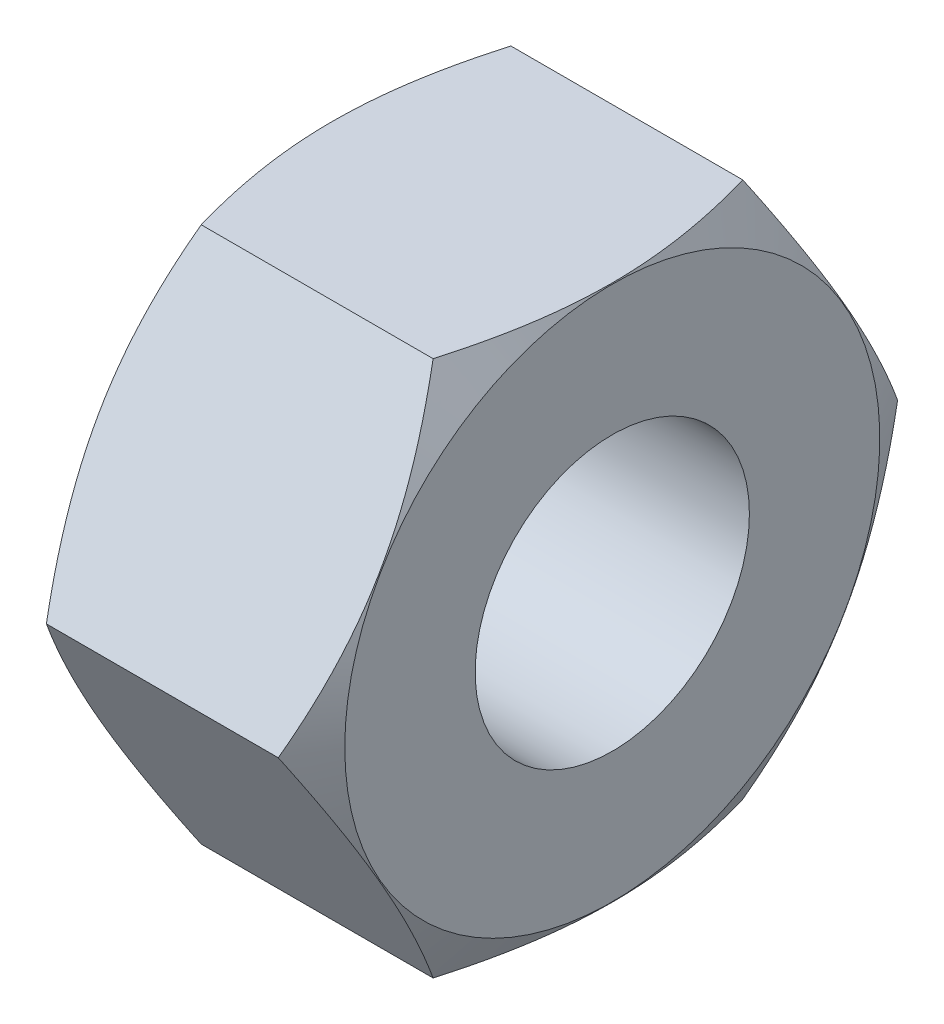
ISO-10303-21;
HEADER;
FILE_DESCRIPTION(('STEP AP214'),'2;1');
FILE_NAME('part.step','',(''),(''),'','','');
FILE_SCHEMA(('AUTOMOTIVE_DESIGN { 1 0 10303 214 1 1 1 1 }'));
ENDSEC;
DATA;
#1=APPLICATION_CONTEXT('core data for automotive mechanical design processes');
#2=APPLICATION_PROTOCOL_DEFINITION('international standard','automotive_design',2000,#1);
#3=PRODUCT_CONTEXT('',#1,'mechanical');
#4=PRODUCT('Part','Part','',(#3));
#5=PRODUCT_RELATED_PRODUCT_CATEGORY('part','',(#4));
#6=PRODUCT_DEFINITION_FORMATION('','',#4);
#7=PRODUCT_DEFINITION_CONTEXT('part definition',#1,'design');
#8=PRODUCT_DEFINITION('design','',#6,#7);
#9=PRODUCT_DEFINITION_SHAPE('','',#8);
#10=(LENGTH_UNIT() NAMED_UNIT(*) SI_UNIT(.MILLI.,.METRE.));
#11=(NAMED_UNIT(*) PLANE_ANGLE_UNIT() SI_UNIT($,.RADIAN.));
#12=(NAMED_UNIT(*) SI_UNIT($,.STERADIAN.) SOLID_ANGLE_UNIT());
#13=UNCERTAINTY_MEASURE_WITH_UNIT(LENGTH_MEASURE(1.E-05),#10,'distance_accuracy_value','');
#14=(GEOMETRIC_REPRESENTATION_CONTEXT(3) GLOBAL_UNCERTAINTY_ASSIGNED_CONTEXT((#13)) GLOBAL_UNIT_ASSIGNED_CONTEXT((#10,
#11,#12)) REPRESENTATION_CONTEXT('',''));
#15=CARTESIAN_POINT('',(0.,0.,0.));
#16=DIRECTION('',(0.,0.,1.));
#17=DIRECTION('',(1.,0.,0.));
#18=AXIS2_PLACEMENT_3D('',#15,#16,#17);
#19=CARTESIAN_POINT('',(0.593466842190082,0.,0.));
#20=DIRECTION('',(1.,0.,0.));
#21=DIRECTION('',(0.,0.,-1.));
#22=AXIS2_PLACEMENT_3D('',#19,#20,#21);
#23=CONICAL_SURFACE('',#22,7.51170524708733,1.0471975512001);
#24=CARTESIAN_POINT('',(-1.40280582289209E-11,0.,0.));
#25=DIRECTION('',(1.,0.,0.));
#26=DIRECTION('',(0.,0.,-1.));
#27=AXIS2_PLACEMENT_3D('',#24,#25,#26);
#28=CIRCLE('',#27,6.48379052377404);
#29=CARTESIAN_POINT('',(-1.40280582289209E-11,0.,-6.48379052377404));
#30=VERTEX_POINT('',#29);
#31=EDGE_CURVE('E204',#30,#30,#28,.T.);
#32=ORIENTED_EDGE('',*,*,#31,.T.);
#33=EDGE_LOOP('',(#32));
#34=FACE_BOUND('',#33,.T.);
#35=CARTESIAN_POINT('',(0.589915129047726,6.50000000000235,3.7527767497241));
#36=CARTESIAN_POINT('',(0.497350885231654,6.222421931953,3.91303652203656));
#37=CARTESIAN_POINT('',(0.412937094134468,5.94247463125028,4.07466417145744));
#38=CARTESIAN_POINT('',(0.264800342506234,5.37785705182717,4.40064628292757));
#39=CARTESIAN_POINT('',(0.201126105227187,5.09317727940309,4.56500622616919));
#40=CARTESIAN_POINT('',(0.125389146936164,4.66702336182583,4.81104630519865));
#41=CARTESIAN_POINT('',(0.103592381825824,4.52684665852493,4.89197736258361));
#42=CARTESIAN_POINT('',(0.0665264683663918,4.24585407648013,5.05420850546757));
#43=CARTESIAN_POINT('',(0.0512567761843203,4.10503825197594,5.13550855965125));
#44=CARTESIAN_POINT('',(0.0276084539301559,3.82312243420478,5.29827273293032));
#45=CARTESIAN_POINT('',(0.019222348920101,3.68202291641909,5.37973657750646));
#46=CARTESIAN_POINT('',(0.00950567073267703,3.39965097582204,5.54276409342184));
#47=CARTESIAN_POINT('',(0.00817494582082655,3.2583785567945,5.62432776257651));
#48=CARTESIAN_POINT('',(0.014519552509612,2.85630623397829,5.85646432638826));
#49=CARTESIAN_POINT('',(0.0307736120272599,2.59557331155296,6.0069985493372));
#50=CARTESIAN_POINT('',(0.0863078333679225,2.0757589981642,6.30711348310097));
#51=CARTESIAN_POINT('',(0.125610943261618,1.8166795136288,6.45669309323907));
#52=CARTESIAN_POINT('',(0.225539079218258,1.29560655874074,6.75753470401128));
#53=CARTESIAN_POINT('',(0.286631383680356,1.03368204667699,6.90875689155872));
#54=CARTESIAN_POINT('',(0.426173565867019,0.513867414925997,7.20887200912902));
#55=CARTESIAN_POINT('',(0.504587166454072,0.255970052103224,7.35776912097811));
#56=CARTESIAN_POINT('',(0.589915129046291,-6.67449645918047E-12,7.50555349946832));
#57=B_SPLINE_CURVE_WITH_KNOTS('',3,(#35,#36,#37,#38,#39,#40,#41,#42,#43,#44,#45,#46,#47,#48,#49,
#50,#51,#52,#53,#54,#55,#56),.UNSPECIFIED.,.F.,.F.,(4,2,2,2,2,2,2,2,2,2,4),(0.,1.00133567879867,
2.00500709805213,2.49485540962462,2.98466289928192,3.47393779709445,3.96320217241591,
4.86669636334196,5.77109162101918,6.69617980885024,7.61934858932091),.UNSPECIFIED.);
#58=CARTESIAN_POINT('',(0.589915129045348,6.50000000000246,3.75277674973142));
#59=VERTEX_POINT('',#58);
#60=CARTESIAN_POINT('',(0.589915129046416,-1.58766122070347E-13,7.50555349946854));
#61=VERTEX_POINT('',#60);
#62=EDGE_CURVE('E177',#59,#61,#57,.T.);
#63=ORIENTED_EDGE('',*,*,#62,.F.);
#64=CARTESIAN_POINT('',(0.589915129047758,6.49999999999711,-3.75277674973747));
#65=CARTESIAN_POINT('',(0.542299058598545,6.49999999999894,-3.58779801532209));
#66=CARTESIAN_POINT('',(0.496844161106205,6.49999999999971,-3.4222041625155));
#67=CARTESIAN_POINT('',(0.410851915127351,6.50000000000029,-3.08967168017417));
#68=CARTESIAN_POINT('',(0.370316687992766,6.5000000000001,-2.92273250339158));
#69=CARTESIAN_POINT('',(0.256886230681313,6.4999999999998,-2.41924225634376));
#70=CARTESIAN_POINT('',(0.192369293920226,6.49999999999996,-2.08070380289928));
#71=CARTESIAN_POINT('',(0.116717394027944,6.50000000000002,-1.57408720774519));
#72=CARTESIAN_POINT('',(0.0951667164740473,6.50000000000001,-1.40752263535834));
#73=CARTESIAN_POINT('',(0.0590302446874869,6.5,-1.07364097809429));
#74=CARTESIAN_POINT('',(0.0444438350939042,6.5,-0.906323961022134));
#75=CARTESIAN_POINT('',(0.0226076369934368,6.5,-0.571399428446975));
#76=CARTESIAN_POINT('',(0.0153495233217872,6.5,-0.403792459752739));
#77=CARTESIAN_POINT('',(0.00831775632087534,6.5,-0.0684330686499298));
#78=CARTESIAN_POINT('',(0.00854387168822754,6.5,0.0993193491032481));
#79=CARTESIAN_POINT('',(0.0194500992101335,6.5,0.558877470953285));
#80=CARTESIAN_POINT('',(0.0377495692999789,6.5,0.85053265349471));
#81=CARTESIAN_POINT('',(0.0957710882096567,6.5,1.43190592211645));
#82=CARTESIAN_POINT('',(0.135512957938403,6.5,1.72162196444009));
#83=CARTESIAN_POINT('',(0.234853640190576,6.5,2.30416471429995));
#84=CARTESIAN_POINT('',(0.294873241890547,6.5,2.59691793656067));
#85=CARTESIAN_POINT('',(0.431092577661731,6.5,3.17805924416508));
#86=CARTESIAN_POINT('',(0.507260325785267,6.5,3.46645476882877));
#87=CARTESIAN_POINT('',(0.589915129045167,6.5,3.75277674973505));
#88=B_SPLINE_CURVE_WITH_KNOTS('',3,(#64,#65,#66,#67,#68,#69,#70,#71,#72,#73,#74,#75,#76,#77,#78,
#79,#80,#81,#82,#83,#84,#85,#86,#87),.UNSPECIFIED.,.F.,.F.,(4,2,2,2,2,2,2,2,2,2,2,4),(0.,
0.515097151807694,1.03041562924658,2.0631934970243,2.56693469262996,3.07063136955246,
3.57375518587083,4.07686345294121,4.95263085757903,5.82920919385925,6.72522583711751,
7.61948397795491),.UNSPECIFIED.);
#89=CARTESIAN_POINT('',(0.589915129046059,6.5000000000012,-3.75277674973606));
#90=VERTEX_POINT('',#89);
#91=EDGE_CURVE('E86',#90,#59,#88,.T.);
#92=ORIENTED_EDGE('',*,*,#91,.F.);
#93=CARTESIAN_POINT('',(0.589915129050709,-4.49230760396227E-12,-7.50555349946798));
#94=CARTESIAN_POINT('',(0.542299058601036,0.142875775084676,-7.42306413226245));
#95=CARTESIAN_POINT('',(0.496844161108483,0.286284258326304,-7.34026720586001));
#96=CARTESIAN_POINT('',(0.410851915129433,0.57426583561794,-7.17400096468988));
#97=CARTESIAN_POINT('',(0.370316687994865,0.718839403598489,-7.09053137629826));
#98=CARTESIAN_POINT('',(0.256886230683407,1.15487474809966,-6.83878625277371));
#99=CARTESIAN_POINT('',(0.192369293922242,1.44805764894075,-6.66951702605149));
#100=CARTESIAN_POINT('',(0.116717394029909,1.88680049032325,-6.41620872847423));
#101=CARTESIAN_POINT('',(0.0951667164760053,2.03104964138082,-6.33292644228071));
#102=CARTESIAN_POINT('',(0.0590302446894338,2.32019963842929,-6.1659856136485));
#103=CARTESIAN_POINT('',(0.0444438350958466,2.46510042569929,-6.08232710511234));
#104=CARTESIAN_POINT('',(0.0226076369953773,2.75515357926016,-5.91486483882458));
#105=CARTESIAN_POINT('',(0.0153495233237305,2.90030547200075,-5.83106135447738));
#106=CARTESIAN_POINT('',(0.00831775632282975,3.19073522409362,-5.6633816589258));
#107=CARTESIAN_POINT('',(0.00854387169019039,3.33601307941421,-5.57950545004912));
#108=CARTESIAN_POINT('',(0.0194500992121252,3.73400208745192,-5.34972638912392));
#109=CARTESIAN_POINT('',(0.0377495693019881,3.98658288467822,-5.20389879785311));
#110=CARTESIAN_POINT('',(0.0957710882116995,4.49006690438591,-4.91321216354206));
#111=CARTESIAN_POINT('',(0.135512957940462,4.7409683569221,-4.76835414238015));
#112=CARTESIAN_POINT('',(0.234853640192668,5.24546517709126,-4.47708276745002));
#113=CARTESIAN_POINT('',(0.294873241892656,5.49899690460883,-4.33070615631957));
#114=CARTESIAN_POINT('',(0.431092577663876,6.00228004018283,-4.04013550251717));
#115=CARTESIAN_POINT('',(0.507260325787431,6.25203789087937,-3.89593774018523));
#116=CARTESIAN_POINT('',(0.58991512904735,6.50000000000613,-3.752776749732));
#117=B_SPLINE_CURVE_WITH_KNOTS('',3,(#93,#94,#95,#96,#97,#98,#99,#100,#101,#102,#103,#104,#105,
#106,#107,#108,#109,#110,#111,#112,#113,#114,#115,#116),.UNSPECIFIED.,.F.,.F.,(4,2,2,2,2,2,2,2,
2,2,2,4),(0.,0.515097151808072,1.03041562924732,2.06319349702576,2.56693469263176,
3.07063136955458,3.57375518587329,4.07686345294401,4.95263085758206,5.82920919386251,
6.72522583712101,7.61948397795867),.UNSPECIFIED.);
#118=CARTESIAN_POINT('',(0.589915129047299,1.80628389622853E-12,-7.50555349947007));
#119=VERTEX_POINT('',#118);
#120=EDGE_CURVE('E173',#119,#90,#117,.T.);
#121=ORIENTED_EDGE('',*,*,#120,.F.);
#122=CARTESIAN_POINT('',(0.589915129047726,-6.50000000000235,-3.7527767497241));
#123=CARTESIAN_POINT('',(0.497350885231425,-6.22242193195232,-3.91303652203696));
#124=CARTESIAN_POINT('',(0.412937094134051,-5.9424746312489,-4.07466417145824));
#125=CARTESIAN_POINT('',(0.264800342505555,-5.37785705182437,-4.40064628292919));
#126=CARTESIAN_POINT('',(0.201126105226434,-5.09317727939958,-4.56500622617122));
#127=CARTESIAN_POINT('',(0.125389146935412,-4.66702336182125,-4.8110463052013));
#128=CARTESIAN_POINT('',(0.10359238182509,-4.52684665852,-4.89197736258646));
#129=CARTESIAN_POINT('',(0.0665264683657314,-4.2458540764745,-5.05420850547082));
#130=CARTESIAN_POINT('',(0.0512567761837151,-4.10503825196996,-5.1355085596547));
#131=CARTESIAN_POINT('',(0.0276084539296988,-3.82312243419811,-5.29827273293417));
#132=CARTESIAN_POINT('',(0.0192223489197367,-3.68202291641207,-5.37973657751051));
#133=CARTESIAN_POINT('',(0.00950567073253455,-3.39965097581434,-5.5427640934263));
#134=CARTESIAN_POINT('',(0.00817494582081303,-3.25837855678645,-5.62432776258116));
#135=CARTESIAN_POINT('',(0.0145195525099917,-2.85630623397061,-5.8564643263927));
#136=CARTESIAN_POINT('',(0.0307736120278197,-2.59557331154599,-6.00699854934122));
#137=CARTESIAN_POINT('',(0.0863078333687,-2.07575899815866,-6.30711348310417));
#138=CARTESIAN_POINT('',(0.125610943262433,-1.81667951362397,-6.45669309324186));
#139=CARTESIAN_POINT('',(0.225539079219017,-1.29560655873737,-6.75753470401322));
#140=CARTESIAN_POINT('',(0.286631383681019,-1.03368204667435,-6.90875689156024));
#141=CARTESIAN_POINT('',(0.426173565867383,-0.513867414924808,-7.2088720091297));
#142=CARTESIAN_POINT('',(0.504587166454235,-0.255970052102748,-7.35776912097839));
#143=CARTESIAN_POINT('',(0.589915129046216,6.44867053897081E-12,-7.50555349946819));
#144=B_SPLINE_CURVE_WITH_KNOTS('',3,(#122,#123,#124,#125,#126,#127,#128,#129,#130,#131,#132,
#133,#134,#135,#136,#137,#138,#139,#140,#141,#142,#143),.UNSPECIFIED.,.F.,.F.,(4,2,2,2,2,2,2,2,
2,2,4),(0.,1.00133567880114,2.00500709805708,2.49485540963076,2.98466289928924,3.47393779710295,
3.9632021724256,4.86669636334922,5.771091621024,6.6961798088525,7.61934858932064),.UNSPECIFIED.);
#145=CARTESIAN_POINT('',(0.589915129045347,-6.50000000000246,-3.75277674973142));
#146=VERTEX_POINT('',#145);
#147=EDGE_CURVE('E74',#146,#119,#144,.T.);
#148=ORIENTED_EDGE('',*,*,#147,.F.);
#149=CARTESIAN_POINT('',(0.589915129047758,-6.49999999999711,3.75277674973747));
#150=CARTESIAN_POINT('',(0.542299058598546,-6.49999999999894,3.5877980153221));
#151=CARTESIAN_POINT('',(0.496844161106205,-6.49999999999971,3.42220416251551));
#152=CARTESIAN_POINT('',(0.410851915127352,-6.50000000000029,3.08967168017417));
#153=CARTESIAN_POINT('',(0.370316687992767,-6.5000000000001,2.92273250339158));
#154=CARTESIAN_POINT('',(0.256886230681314,-6.4999999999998,2.41924225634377));
#155=CARTESIAN_POINT('',(0.192369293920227,-6.49999999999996,2.08070380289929));
#156=CARTESIAN_POINT('',(0.116717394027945,-6.50000000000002,1.57408720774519));
#157=CARTESIAN_POINT('',(0.0951667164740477,-6.5,1.40752263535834));
#158=CARTESIAN_POINT('',(0.0590302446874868,-6.5,1.07364097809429));
#159=CARTESIAN_POINT('',(0.0444438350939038,-6.5,0.906323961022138));
#160=CARTESIAN_POINT('',(0.0226076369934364,-6.5,0.571399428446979));
#161=CARTESIAN_POINT('',(0.0153495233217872,-6.5,0.403792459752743));
#162=CARTESIAN_POINT('',(0.00831775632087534,-6.5,0.0684330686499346));
#163=CARTESIAN_POINT('',(0.00854387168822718,-6.5,-0.0993193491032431));
#164=CARTESIAN_POINT('',(0.0194500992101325,-6.5,-0.558877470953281));
#165=CARTESIAN_POINT('',(0.0377495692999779,-6.5,-0.850532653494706));
#166=CARTESIAN_POINT('',(0.0957710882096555,-6.5,-1.43190592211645));
#167=CARTESIAN_POINT('',(0.135512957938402,-6.5,-1.72162196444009));
#168=CARTESIAN_POINT('',(0.234853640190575,-6.5,-2.30416471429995));
#169=CARTESIAN_POINT('',(0.294873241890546,-6.5,-2.59691793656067));
#170=CARTESIAN_POINT('',(0.43109257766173,-6.5,-3.17805924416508));
#171=CARTESIAN_POINT('',(0.507260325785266,-6.5,-3.46645476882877));
#172=CARTESIAN_POINT('',(0.589915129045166,-6.5,-3.75277674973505));
#173=B_SPLINE_CURVE_WITH_KNOTS('',3,(#149,#150,#151,#152,#153,#154,#155,#156,#157,#158,#159,
#160,#161,#162,#163,#164,#165,#166,#167,#168,#169,#170,#171,#172),.UNSPECIFIED.,.F.,.F.,(4,2,2,
2,2,2,2,2,2,2,2,4),(0.,0.515097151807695,1.03041562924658,2.0631934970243,2.56693469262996,
3.07063136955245,3.57375518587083,4.07686345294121,4.95263085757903,5.82920919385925,
6.72522583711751,7.61948397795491),.UNSPECIFIED.);
#174=CARTESIAN_POINT('',(0.589915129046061,-6.5000000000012,3.75277674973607));
#175=VERTEX_POINT('',#174);
#176=EDGE_CURVE('E20',#175,#146,#173,.T.);
#177=ORIENTED_EDGE('',*,*,#176,.F.);
#178=CARTESIAN_POINT('',(0.589915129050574,3.59837280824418E-12,7.5055534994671));
#179=CARTESIAN_POINT('',(0.542299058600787,-0.142875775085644,7.42306413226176));
#180=CARTESIAN_POINT('',(0.496844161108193,-0.286284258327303,7.3402672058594));
#181=CARTESIAN_POINT('',(0.410851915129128,-0.574265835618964,7.17400096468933));
#182=CARTESIAN_POINT('',(0.370316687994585,-0.718839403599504,7.09053137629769));
#183=CARTESIAN_POINT('',(0.25688623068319,-1.15487474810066,6.83878625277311));
#184=CARTESIAN_POINT('',(0.192369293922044,-1.44805764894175,6.66951702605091));
#185=CARTESIAN_POINT('',(0.116717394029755,-1.88680049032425,6.41620872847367));
#186=CARTESIAN_POINT('',(0.095166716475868,-2.03104964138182,6.33292644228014));
#187=CARTESIAN_POINT('',(0.0590302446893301,-2.32019963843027,6.16598561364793));
#188=CARTESIAN_POINT('',(0.0444438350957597,-2.46510042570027,6.08232710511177));
#189=CARTESIAN_POINT('',(0.0226076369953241,-2.75515357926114,5.91486483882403));
#190=CARTESIAN_POINT('',(0.0153495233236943,-2.90030547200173,5.83106135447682));
#191=CARTESIAN_POINT('',(0.00831775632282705,-3.19073522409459,5.66338165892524));
#192=CARTESIAN_POINT('',(0.00854387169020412,-3.33601307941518,5.57950545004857));
#193=CARTESIAN_POINT('',(0.0194500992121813,-3.7340020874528,5.34972638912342));
#194=CARTESIAN_POINT('',(0.0377495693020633,-3.98658288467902,5.20389879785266));
#195=CARTESIAN_POINT('',(0.0957710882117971,-4.49006690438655,4.91321216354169));
#196=CARTESIAN_POINT('',(0.135512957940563,-4.74096835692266,4.76835414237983));
#197=CARTESIAN_POINT('',(0.234853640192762,-5.24546517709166,4.4770827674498));
#198=CARTESIAN_POINT('',(0.294873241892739,-5.49899690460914,4.33070615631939));
#199=CARTESIAN_POINT('',(0.431092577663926,-6.00228004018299,4.04013550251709));
#200=CARTESIAN_POINT('',(0.50726032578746,-6.25203789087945,3.89593774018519));
#201=CARTESIAN_POINT('',(0.589915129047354,-6.50000000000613,3.752776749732));
#202=B_SPLINE_CURVE_WITH_KNOTS('',3,(#178,#179,#180,#181,#182,#183,#184,#185,#186,#187,#188,
#189,#190,#191,#192,#193,#194,#195,#196,#197,#198,#199,#200,#201),.UNSPECIFIED.,.F.,.F.,(4,2,2,
2,2,2,2,2,2,2,2,4),(0.,0.515097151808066,1.03041562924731,2.06319349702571,2.5669346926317,
3.0706313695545,3.5737551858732,4.0768634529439,4.95263085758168,5.82920919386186,
6.72522583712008,7.61948397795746),.UNSPECIFIED.);
#203=EDGE_CURVE('E72',#61,#175,#202,.T.);
#204=ORIENTED_EDGE('',*,*,#203,.F.);
#205=EDGE_LOOP('',(#63,#92,#121,#148,#177,#204));
#206=FACE_BOUND('',#205,.T.);
#207=ADVANCED_FACE('F16',(#34,#206),#23,.T.);
#208=CARTESIAN_POINT('',(0.,-6.5,3.75277674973));
#209=DIRECTION('',(0.,-1.,0.));
#210=DIRECTION('',(0.,0.,-1.));
#211=AXIS2_PLACEMENT_3D('',#208,#209,#210);
#212=PLANE('',#211);
#213=CARTESIAN_POINT('',(6.21008489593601,-6.5,3.75277666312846));
#214=CARTESIAN_POINT('',(6.25770096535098,-6.5,3.58779792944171));
#215=CARTESIAN_POINT('',(6.30315586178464,-6.5,3.42220407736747));
#216=CARTESIAN_POINT('',(6.38914810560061,-6.5,3.08967159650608));
#217=CARTESIAN_POINT('',(6.42968333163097,-6.5,2.92273242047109));
#218=CARTESIAN_POINT('',(6.54311378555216,-6.5,2.41924217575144));
#219=CARTESIAN_POINT('',(6.60763071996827,-6.5,2.08070372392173));
#220=CARTESIAN_POINT('',(6.68328261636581,-6.5,1.57408713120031));
#221=CARTESIAN_POINT('',(6.70483329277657,-6.5,1.40752255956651));
#222=CARTESIAN_POINT('',(6.74096976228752,-6.5,1.07364090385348));
#223=CARTESIAN_POINT('',(6.75555617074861,-6.5,0.906323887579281));
#224=CARTESIAN_POINT('',(6.7773923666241,-6.5,0.571399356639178));
#225=CARTESIAN_POINT('',(6.7846504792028,-6.5,0.403792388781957));
#226=CARTESIAN_POINT('',(6.79168224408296,-6.5,0.0684329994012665));
#227=CARTESIAN_POINT('',(6.79145612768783,-6.5,-0.0993194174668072));
#228=CARTESIAN_POINT('',(6.78054989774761,-6.5,-0.558877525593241));
#229=CARTESIAN_POINT('',(6.76225042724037,-6.5,-0.850532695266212));
#230=CARTESIAN_POINT('',(6.7042289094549,-6.5,-1.43190593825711));
#231=CARTESIAN_POINT('',(6.66448704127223,-6.5,-1.72162196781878));
#232=CARTESIAN_POINT('',(6.56514636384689,-6.5,-2.30416469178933));
#233=CARTESIAN_POINT('',(6.50512676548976,-6.5,-2.59691790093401));
#234=CARTESIAN_POINT('',(6.36890743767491,-6.5,-3.17805918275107));
#235=CARTESIAN_POINT('',(6.29273969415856,-6.5,-3.46645469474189));
#236=CARTESIAN_POINT('',(6.21008489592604,-6.5,-3.752776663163));
#237=B_SPLINE_CURVE_WITH_KNOTS('',3,(#213,#214,#215,#216,#217,#218,#219,#220,#221,#222,#223,
#224,#225,#226,#227,#228,#229,#230,#231,#232,#233,#234,#235,#236),.UNSPECIFIED.,.F.,.F.,(4,2,2,
2,2,2,2,2,2,2,2,4),(0.,0.51509714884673,1.03041562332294,2.06319348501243,2.56693467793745,
3.07063135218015,3.57375516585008,4.07686343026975,4.95263079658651,5.82920909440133,
6.72522569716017,7.61948379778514),.UNSPECIFIED.);
#238=CARTESIAN_POINT('',(6.21008488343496,-6.5000000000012,3.75277670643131));
#239=VERTEX_POINT('',#238);
#240=CARTESIAN_POINT('',(6.21008486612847,-6.50000001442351,-3.75277674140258));
#241=VERTEX_POINT('',#240);
#242=EDGE_CURVE('E82',#239,#241,#237,.T.);
#243=ORIENTED_EDGE('',*,*,#242,.F.);
#244=DIRECTION('',(1.,0.,0.));
#245=VECTOR('',#244,1.);
#246=CARTESIAN_POINT('',(0.,-6.5000000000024,3.75277674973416));
#247=LINE('',#246,#245);
#248=EDGE_CURVE('E79',#175,#239,#247,.T.);
#249=ORIENTED_EDGE('',*,*,#248,.F.);
#250=ORIENTED_EDGE('',*,*,#176,.T.);
#251=DIRECTION('',(1.,0.,0.));
#252=VECTOR('',#251,1.);
#253=CARTESIAN_POINT('',(0.,-6.5,-3.75277674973));
#254=LINE('',#253,#252);
#255=EDGE_CURVE('E171',#241,#146,#254,.F.);
#256=ORIENTED_EDGE('',*,*,#255,.F.);
#257=EDGE_LOOP('',(#243,#249,#250,#256));
#258=FACE_BOUND('',#257,.T.);
#259=ADVANCED_FACE('F80',(#258),#212,.T.);
#260=CARTESIAN_POINT('',(0.,0.,7.50555349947));
#261=DIRECTION('',(0.,-0.50000000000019,0.866025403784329));
#262=DIRECTION('',(0.,-0.866025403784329,-0.50000000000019));
#263=AXIS2_PLACEMENT_3D('',#260,#261,#262);
#264=PLANE('',#263);
#265=CARTESIAN_POINT('',(6.21008486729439,-1.65405709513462E-08,7.50555346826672));
#266=CARTESIAN_POINT('',(6.25770094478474,-0.142875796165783,7.42306411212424));
#267=CARTESIAN_POINT('',(6.30315584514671,-0.28628428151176,7.34026719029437));
#268=CARTESIAN_POINT('',(6.38914809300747,-0.574265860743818,7.1740009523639));
#269=CARTESIAN_POINT('',(6.4296833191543,-0.718839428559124,7.09053136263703));
#270=CARTESIAN_POINT('',(6.54311377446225,-1.15487477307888,6.83878623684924));
#271=CARTESIAN_POINT('',(6.60763071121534,-1.44805767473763,6.66951701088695));
#272=CARTESIAN_POINT('',(6.68328261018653,-1.88680051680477,6.41620871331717));
#273=CARTESIAN_POINT('',(6.70483328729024,-2.03104966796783,6.33292642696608));
#274=CARTESIAN_POINT('',(6.74096975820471,-2.32019966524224,6.16598559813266));
#275=CARTESIAN_POINT('',(6.7555561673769,-2.46510045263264,6.08232708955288));
#276=CARTESIAN_POINT('',(6.7773923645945,-2.75515360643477,5.9148648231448));
#277=CARTESIAN_POINT('',(6.78465047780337,-2.90030549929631,5.83106133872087));
#278=CARTESIAN_POINT('',(6.79168224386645,-3.19073525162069,5.66338164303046));
#279=CARTESIAN_POINT('',(6.79145612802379,-3.33601310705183,5.57950543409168));
#280=CARTESIAN_POINT('',(6.78054989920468,-3.73400211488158,5.34972637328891));
#281=CARTESIAN_POINT('',(6.76225042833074,-3.98658291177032,5.20389878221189));
#282=CARTESIAN_POINT('',(6.70422890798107,-4.49006693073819,4.91321214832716));
#283=CARTESIAN_POINT('',(6.66448703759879,-4.74096838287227,4.7683541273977));
#284=CARTESIAN_POINT('',(6.56514635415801,-5.2454652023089,4.47708275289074));
#285=CARTESIAN_POINT('',(6.50512675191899,-5.4989969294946,4.33070614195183));
#286=CARTESIAN_POINT('',(6.36890741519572,-6.00228006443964,4.04013548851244));
#287=CARTESIAN_POINT('',(6.29273966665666,-6.25203791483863,3.89593772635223));
#288=CARTESIAN_POINT('',(6.21008486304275,-6.50000002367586,3.75277673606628));
#289=B_SPLINE_CURVE_WITH_KNOTS('',3,(#265,#266,#267,#268,#269,#270,#271,#272,#273,#274,#275,
#276,#277,#278,#279,#280,#281,#282,#283,#284,#285,#286,#287,#288),.UNSPECIFIED.,.F.,.F.,(4,2,2,
2,2,2,2,2,2,2,2,4),(0.,0.515097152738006,1.03041563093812,2.06319349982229,2.56693469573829,
3.0706313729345,3.5737551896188,4.07686345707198,4.95263086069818,5.82920919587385,
6.72522583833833,7.61948397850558),.UNSPECIFIED.);
#290=CARTESIAN_POINT('',(6.21008487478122,-1.15430160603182E-08,7.50555349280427));
#291=VERTEX_POINT('',#290);
#292=EDGE_CURVE('E110',#291,#239,#289,.T.);
#293=ORIENTED_EDGE('',*,*,#292,.F.);
#294=DIRECTION('',(1.,0.,0.));
#295=VECTOR('',#294,1.);
#296=CARTESIAN_POINT('',(0.,-2.4086635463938E-12,7.50555349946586));
#297=LINE('',#296,#295);
#298=EDGE_CURVE('E90',#61,#291,#297,.T.);
#299=ORIENTED_EDGE('',*,*,#298,.F.);
#300=ORIENTED_EDGE('',*,*,#203,.T.);
#301=ORIENTED_EDGE('',*,*,#248,.T.);
#302=EDGE_LOOP('',(#293,#299,#300,#301));
#303=FACE_BOUND('',#302,.T.);
#304=ADVANCED_FACE('F88',(#303),#264,.T.);
#305=CARTESIAN_POINT('',(0.,6.5,-3.75277674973));
#306=DIRECTION('',(0.,1.,0.));
#307=DIRECTION('',(0.,0.,1.));
#308=AXIS2_PLACEMENT_3D('',#305,#306,#307);
#309=PLANE('',#308);
#310=CARTESIAN_POINT('',(6.21008489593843,6.5,-3.75277666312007));
#311=CARTESIAN_POINT('',(6.2577009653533,6.5,-3.5877979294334));
#312=CARTESIAN_POINT('',(6.30315586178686,6.5,-3.42220407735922));
#313=CARTESIAN_POINT('',(6.38914810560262,6.5,-3.08967159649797));
#314=CARTESIAN_POINT('',(6.42968333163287,6.5,-2.92273242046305));
#315=CARTESIAN_POINT('',(6.54311378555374,6.5,-2.41924217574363));
#316=CARTESIAN_POINT('',(6.60763071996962,6.5,-2.08070372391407));
#317=CARTESIAN_POINT('',(6.68328261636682,6.5,-1.57408713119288));
#318=CARTESIAN_POINT('',(6.70483329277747,6.5,-1.40752255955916));
#319=CARTESIAN_POINT('',(6.74096976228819,6.5,-1.07364090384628));
#320=CARTESIAN_POINT('',(6.75555617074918,6.5,-0.906323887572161));
#321=CARTESIAN_POINT('',(6.77739236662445,6.5,-0.571399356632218));
#322=CARTESIAN_POINT('',(6.78465047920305,6.5,-0.403792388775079));
#323=CARTESIAN_POINT('',(6.791682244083,6.5,-0.0684329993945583));
#324=CARTESIAN_POINT('',(6.79145612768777,6.5,0.0993194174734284));
#325=CARTESIAN_POINT('',(6.7805498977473,6.5,0.558877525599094));
#326=CARTESIAN_POINT('',(6.76225042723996,6.5,0.850532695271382));
#327=CARTESIAN_POINT('',(6.70422890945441,6.5,1.43190593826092));
#328=CARTESIAN_POINT('',(6.66448704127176,6.5,1.7216219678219));
#329=CARTESIAN_POINT('',(6.56514636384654,6.5,2.30416469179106));
#330=CARTESIAN_POINT('',(6.50512676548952,6.5,2.59691790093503));
#331=CARTESIAN_POINT('',(6.36890743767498,6.5,3.17805918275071));
#332=CARTESIAN_POINT('',(6.29273969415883,6.5,3.46645469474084));
#333=CARTESIAN_POINT('',(6.21008489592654,6.5,3.75277666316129));
#334=B_SPLINE_CURVE_WITH_KNOTS('',3,(#310,#311,#312,#313,#314,#315,#316,#317,#318,#319,#320,
#321,#322,#323,#324,#325,#326,#327,#328,#329,#330,#331,#332,#333),.UNSPECIFIED.,.F.,.F.,(4,2,2,
2,2,2,2,2,2,2,2,4),(0.,0.515097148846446,1.03041562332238,2.06319348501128,2.56693467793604,
3.07063135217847,3.57375516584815,4.07686343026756,4.95263079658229,5.82920909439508,
6.72522569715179,7.61948379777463),.UNSPECIFIED.);
#335=CARTESIAN_POINT('',(6.21008488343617,6.5000000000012,-3.75277670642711));
#336=VERTEX_POINT('',#335);
#337=CARTESIAN_POINT('',(6.21008486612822,6.50000001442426,3.75277674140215));
#338=VERTEX_POINT('',#337);
#339=EDGE_CURVE('E117',#336,#338,#334,.T.);
#340=ORIENTED_EDGE('',*,*,#339,.F.);
#341=DIRECTION('',(1.,0.,0.));
#342=VECTOR('',#341,1.);
#343=CARTESIAN_POINT('',(0.,6.5000000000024,-3.75277674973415));
#344=LINE('',#343,#342);
#345=EDGE_CURVE('E189',#90,#336,#344,.T.);
#346=ORIENTED_EDGE('',*,*,#345,.F.);
#347=ORIENTED_EDGE('',*,*,#91,.T.);
#348=DIRECTION('',(1.,0.,0.));
#349=VECTOR('',#348,1.);
#350=CARTESIAN_POINT('',(0.,6.5,3.75277674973));
#351=LINE('',#350,#349);
#352=EDGE_CURVE('E172',#338,#59,#351,.F.);
#353=ORIENTED_EDGE('',*,*,#352,.F.);
#354=EDGE_LOOP('',(#340,#346,#347,#353));
#355=FACE_BOUND('',#354,.T.);
#356=ADVANCED_FACE('F104',(#355),#309,.T.);
#357=CARTESIAN_POINT('',(0.,6.5,3.75277674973));
#358=DIRECTION('',(0.,0.50000000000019,0.866025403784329));
#359=DIRECTION('',(0.,-0.866025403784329,0.50000000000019));
#360=AXIS2_PLACEMENT_3D('',#357,#358,#359);
#361=PLANE('',#360);
#362=CARTESIAN_POINT('',(6.21008483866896,6.50000000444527,3.75277670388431));
#363=CARTESIAN_POINT('',(6.30264909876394,6.22242194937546,3.91303649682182));
#364=CARTESIAN_POINT('',(6.38706289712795,5.94247465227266,4.07466415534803));
#365=CARTESIAN_POINT('',(6.53519965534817,5.37785707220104,4.40064627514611));
#366=CARTESIAN_POINT('',(6.59887389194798,5.09317729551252,4.56500621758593));
#367=CARTESIAN_POINT('',(6.67461085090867,4.66702337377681,4.81104629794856));
#368=CARTESIAN_POINT('',(6.69640761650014,4.526846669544,4.89197735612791));
#369=CARTESIAN_POINT('',(6.73347353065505,4.24585408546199,5.05420850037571));
#370=CARTESIAN_POINT('',(6.74874322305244,4.10503825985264,5.1355085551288));
#371=CARTESIAN_POINT('',(6.77239154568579,3.82312243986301,5.2982727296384));
#372=CARTESIAN_POINT('',(6.78077765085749,3.68202292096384,5.37973657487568));
#373=CARTESIAN_POINT('',(6.79049432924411,3.39965097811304,5.54276409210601));
#374=CARTESIAN_POINT('',(6.79182505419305,3.25837855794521,5.62432776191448));
#375=CARTESIAN_POINT('',(6.78548044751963,2.85630623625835,5.85646432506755));
#376=CARTESIAN_POINT('',(6.76922638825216,2.59557331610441,6.00699854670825));
#377=CARTESIAN_POINT('',(6.71369216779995,2.07575900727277,6.3071134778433));
#378=CARTESIAN_POINT('',(6.67438905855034,1.81667952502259,6.4566930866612));
#379=CARTESIAN_POINT('',(6.57446092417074,1.29560657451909,6.7575346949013));
#380=CARTESIAN_POINT('',(6.51336862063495,1.03368206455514,6.9087568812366));
#381=CARTESIAN_POINT('',(6.37382644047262,0.5138674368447,7.20887199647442));
#382=CARTESIAN_POINT('',(6.29541284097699,0.255970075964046,7.35776910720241));
#383=CARTESIAN_POINT('',(6.21008487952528,2.57679983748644E-08,7.50555348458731));
#384=B_SPLINE_CURVE_WITH_KNOTS('',3,(#362,#363,#364,#365,#366,#367,#368,#369,#370,#371,#372,
#373,#374,#375,#376,#377,#378,#379,#380,#381,#382,#383),.UNSPECIFIED.,.F.,.F.,(4,2,2,2,2,2,2,2,
2,2,4),(0.,1.00133568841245,2.00500711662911,2.49485543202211,2.98466292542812,3.47393782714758,
3.96320220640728,4.86669638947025,5.77109163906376,6.69617981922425,7.6193485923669),.UNSPECIFIED.);
#385=EDGE_CURVE('E138',#338,#291,#384,.T.);
#386=ORIENTED_EDGE('',*,*,#385,.F.);
#387=ORIENTED_EDGE('',*,*,#352,.T.);
#388=ORIENTED_EDGE('',*,*,#62,.T.);
#389=ORIENTED_EDGE('',*,*,#298,.T.);
#390=EDGE_LOOP('',(#386,#387,#388,#389));
#391=FACE_BOUND('',#390,.T.);
#392=ADVANCED_FACE('F162',(#391),#361,.T.);
#393=CARTESIAN_POINT('',(0.,-6.5,-3.75277674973));
#394=DIRECTION('',(0.,-0.50000000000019,-0.866025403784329));
#395=DIRECTION('',(0.,0.866025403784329,-0.50000000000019));
#396=AXIS2_PLACEMENT_3D('',#393,#394,#395);
#397=PLANE('',#396);
#398=CARTESIAN_POINT('',(6.21008483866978,-6.50000000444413,-3.75277670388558));
#399=CARTESIAN_POINT('',(6.30264909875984,-6.22242194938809,-3.91303649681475));
#400=CARTESIAN_POINT('',(6.38706289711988,-5.94247465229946,-4.07466415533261));
#401=CARTESIAN_POINT('',(6.53519965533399,-5.37785707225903,-4.40064627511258));
#402=CARTESIAN_POINT('',(6.59887389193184,-5.09317729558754,-4.56500621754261));
#403=CARTESIAN_POINT('',(6.67461085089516,-4.66702337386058,-4.8110462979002));
#404=CARTESIAN_POINT('',(6.69640761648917,-4.52684666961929,-4.89197735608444));
#405=CARTESIAN_POINT('',(6.73347353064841,-4.24585408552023,-5.05420850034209));
#406=CARTESIAN_POINT('',(6.74874322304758,-4.10503825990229,-5.13550855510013));
#407=CARTESIAN_POINT('',(6.77239154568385,-3.82312243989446,-5.29827272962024));
#408=CARTESIAN_POINT('',(6.78077765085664,-3.68202292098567,-5.37973657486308));
#409=CARTESIAN_POINT('',(6.79049432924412,-3.39965097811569,-5.54276409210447));
#410=CARTESIAN_POINT('',(6.79182505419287,-3.25837855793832,-5.62432776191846));
#411=CARTESIAN_POINT('',(6.7854804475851,-2.85630624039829,-5.85646432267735));
#412=CARTESIAN_POINT('',(6.76922638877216,-2.59557332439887,-6.00699854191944));
#413=CARTESIAN_POINT('',(6.71369216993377,-2.07575902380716,-6.30711346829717));
#414=CARTESIAN_POINT('',(6.67438906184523,-1.81667954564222,-6.45669307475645));
#415=CARTESIAN_POINT('',(6.57446093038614,-1.29560660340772,-6.75753467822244));
#416=CARTESIAN_POINT('',(6.51336862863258,-1.03368209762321,-6.90875686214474));
#417=CARTESIAN_POINT('',(6.37382645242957,-0.513867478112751,-7.2088719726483));
#418=CARTESIAN_POINT('',(6.29541285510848,-0.255970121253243,-7.35776908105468));
#419=CARTESIAN_POINT('',(6.21008489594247,-7.50195800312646E-08,-7.50555345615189));
#420=B_SPLINE_CURVE_WITH_KNOTS('',3,(#398,#399,#400,#401,#402,#403,#404,#405,#406,#407,#408,
#409,#410,#411,#412,#413,#414,#415,#416,#417,#418,#419),.UNSPECIFIED.,.F.,.F.,(4,2,2,2,2,2,2,2,
2,2,4),(0.,1.00133568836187,2.00500711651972,2.49485543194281,2.98466292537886,3.47393782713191,
3.96320220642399,4.86669637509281,5.77109161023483,6.69617977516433,7.6193485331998),.UNSPECIFIED.);
#421=CARTESIAN_POINT('',(6.2100848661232,-1.44286412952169E-08,-7.50555350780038));
#422=VERTEX_POINT('',#421);
#423=EDGE_CURVE('E152',#241,#422,#420,.T.);
#424=ORIENTED_EDGE('',*,*,#423,.F.);
#425=ORIENTED_EDGE('',*,*,#255,.T.);
#426=ORIENTED_EDGE('',*,*,#147,.T.);
#427=DIRECTION('',(1.,0.,0.));
#428=VECTOR('',#427,1.);
#429=CARTESIAN_POINT('',(0.,0.,-7.50555349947));
#430=LINE('',#429,#428);
#431=EDGE_CURVE('E38',#422,#119,#430,.F.);
#432=ORIENTED_EDGE('',*,*,#431,.F.);
#433=EDGE_LOOP('',(#424,#425,#426,#432));
#434=FACE_BOUND('',#433,.T.);
#435=ADVANCED_FACE('F158',(#434),#397,.T.);
#436=CARTESIAN_POINT('',(0.,0.,-7.50555349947));
#437=DIRECTION('',(0.,0.50000000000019,-0.866025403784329));
#438=DIRECTION('',(0.,0.866025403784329,0.50000000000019));
#439=AXIS2_PLACEMENT_3D('',#436,#437,#438);
#440=PLANE('',#439);
#441=CARTESIAN_POINT('',(6.21008483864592,-4.19445104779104E-08,-7.50555348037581));
#442=CARTESIAN_POINT('',(6.25770092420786,0.142875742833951,-7.4230641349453));
#443=CARTESIAN_POINT('',(6.30315582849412,0.286284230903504,-7.34026721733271));
#444=CARTESIAN_POINT('',(6.38914808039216,0.574265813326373,-7.17400098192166));
#445=CARTESIAN_POINT('',(6.42968330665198,0.718839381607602,-7.09053139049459));
#446=CARTESIAN_POINT('',(6.5431137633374,1.15487472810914,-6.83878626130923));
#447=CARTESIAN_POINT('',(6.60763070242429,1.44805763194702,-6.6695170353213));
#448=CARTESIAN_POINT('',(6.68328260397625,1.88680047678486,-6.41620873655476));
#449=CARTESIAN_POINT('',(6.70483328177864,2.03104962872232,-6.33292644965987));
#450=CARTESIAN_POINT('',(6.7409697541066,2.32019962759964,-6.16598561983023));
#451=CARTESIAN_POINT('',(6.7555561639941,2.4651004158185,-6.08232711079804));
#452=CARTESIAN_POINT('',(6.7773923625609,2.75515357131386,-5.91486484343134));
#453=CARTESIAN_POINT('',(6.78465047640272,2.90030546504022,-5.83106135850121));
#454=CARTESIAN_POINT('',(6.79168224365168,3.19073521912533,-5.66338166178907));
#455=CARTESIAN_POINT('',(6.7914561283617,3.33601307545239,-5.57950545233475));
#456=CARTESIAN_POINT('',(6.78054990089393,3.73400208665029,-5.34972638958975));
#457=CARTESIAN_POINT('',(6.76225043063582,3.98658288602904,-5.20389879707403));
#458=CARTESIAN_POINT('',(6.70422891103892,4.49006690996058,-4.91321216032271));
#459=CARTESIAN_POINT('',(6.66448704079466,4.74096836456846,-4.76835413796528));
#460=CARTESIAN_POINT('',(6.5651463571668,5.24546518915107,-4.47708276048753));
#461=CARTESIAN_POINT('',(6.50512675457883,5.49899691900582,-4.33070614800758));
#462=CARTESIAN_POINT('',(6.36890741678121,6.00228005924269,-4.04013549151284));
#463=CARTESIAN_POINT('',(6.29273966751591,6.25203791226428,-3.89593772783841));
#464=CARTESIAN_POINT('',(6.21008486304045,6.50000002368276,-3.75277673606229));
#465=B_SPLINE_CURVE_WITH_KNOTS('',3,(#441,#442,#443,#444,#445,#446,#447,#448,#449,#450,#451,
#452,#453,#454,#455,#456,#457,#458,#459,#460,#461,#462,#463,#464),.UNSPECIFIED.,.F.,.F.,(4,2,2,
2,2,2,2,2,2,2,2,4),(0.,0.515097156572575,1.03041563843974,2.06319351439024,2.56693471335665,
3.07063139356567,3.57375521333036,4.07686348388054,4.95263089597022,5.82920923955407,
6.72522589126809,7.61948404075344),.UNSPECIFIED.);
#466=EDGE_CURVE('E147',#422,#336,#465,.T.);
#467=ORIENTED_EDGE('',*,*,#466,.F.);
#468=ORIENTED_EDGE('',*,*,#431,.T.);
#469=ORIENTED_EDGE('',*,*,#120,.T.);
#470=ORIENTED_EDGE('',*,*,#345,.T.);
#471=EDGE_LOOP('',(#467,#468,#469,#470));
#472=FACE_BOUND('',#471,.T.);
#473=ADVANCED_FACE('F161',(#472),#440,.T.);
#474=CARTESIAN_POINT('',(0.,0.,0.));
#475=DIRECTION('',(1.,0.,0.));
#476=DIRECTION('',(0.,0.,-1.));
#477=AXIS2_PLACEMENT_3D('',#474,#475,#476);
#478=PLANE('',#477);
#479=CARTESIAN_POINT('',(0.,0.,0.));
#480=DIRECTION('',(1.,0.,0.));
#481=DIRECTION('',(0.,0.,-1.));
#482=AXIS2_PLACEMENT_3D('',#479,#480,#481);
#483=CIRCLE('',#482,3.3235);
#484=CARTESIAN_POINT('',(0.,0.,-3.3235));
#485=VERTEX_POINT('',#484);
#486=EDGE_CURVE('E197',#485,#485,#483,.T.);
#487=ORIENTED_EDGE('',*,*,#486,.T.);
#488=EDGE_LOOP('',(#487));
#489=FACE_BOUND('',#488,.T.);
#490=ORIENTED_EDGE('',*,*,#31,.F.);
#491=EDGE_LOOP('',(#490));
#492=FACE_BOUND('',#491,.T.);
#493=ADVANCED_FACE('F132',(#489,#492),#478,.F.);
#494=CARTESIAN_POINT('',(6.2065453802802,0.,0.));
#495=DIRECTION('',(-1.,0.,0.));
#496=DIRECTION('',(0.,0.,1.));
#497=AXIS2_PLACEMENT_3D('',#494,#495,#496);
#498=CONICAL_SURFACE('',#497,7.51168407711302,1.04719755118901);
#499=CARTESIAN_POINT('',(6.80000000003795,0.,0.));
#500=DIRECTION('',(-1.,0.,0.));
#501=DIRECTION('',(0.,0.,1.));
#502=AXIS2_PLACEMENT_3D('',#499,#500,#501);
#503=CIRCLE('',#502,6.48379052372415);
#504=CARTESIAN_POINT('',(6.80000000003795,0.,6.48379052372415));
#505=VERTEX_POINT('',#504);
#506=EDGE_CURVE('E29',#505,#505,#503,.F.);
#507=ORIENTED_EDGE('',*,*,#506,.F.);
#508=EDGE_LOOP('',(#507));
#509=FACE_BOUND('',#508,.T.);
#510=ORIENTED_EDGE('',*,*,#423,.T.);
#511=ORIENTED_EDGE('',*,*,#466,.T.);
#512=ORIENTED_EDGE('',*,*,#339,.T.);
#513=ORIENTED_EDGE('',*,*,#385,.T.);
#514=ORIENTED_EDGE('',*,*,#292,.T.);
#515=ORIENTED_EDGE('',*,*,#242,.T.);
#516=EDGE_LOOP('',(#510,#511,#512,#513,#514,#515));
#517=FACE_BOUND('',#516,.T.);
#518=ADVANCED_FACE('F126',(#509,#517),#498,.T.);
#519=CARTESIAN_POINT('',(3.4,0.,0.));
#520=DIRECTION('',(1.,0.,0.));
#521=DIRECTION('',(0.,0.,-1.));
#522=AXIS2_PLACEMENT_3D('',#519,#520,#521);
#523=CYLINDRICAL_SURFACE('',#522,3.3235);
#524=CARTESIAN_POINT('',(6.8,0.,0.));
#525=DIRECTION('',(1.,0.,0.));
#526=DIRECTION('',(0.,0.,-1.));
#527=AXIS2_PLACEMENT_3D('',#524,#525,#526);
#528=CIRCLE('',#527,3.3235);
#529=CARTESIAN_POINT('',(6.8,0.,-3.3235));
#530=VERTEX_POINT('',#529);
#531=EDGE_CURVE('E11',#530,#530,#528,.F.);
#532=ORIENTED_EDGE('',*,*,#531,.F.);
#533=EDGE_LOOP('',(#532));
#534=FACE_BOUND('',#533,.T.);
#535=ORIENTED_EDGE('',*,*,#486,.F.);
#536=EDGE_LOOP('',(#535));
#537=FACE_BOUND('',#536,.T.);
#538=ADVANCED_FACE('F131',(#534,#537),#523,.F.);
#539=CARTESIAN_POINT('',(6.8,0.,0.));
#540=DIRECTION('',(1.,0.,0.));
#541=DIRECTION('',(0.,0.,-1.));
#542=AXIS2_PLACEMENT_3D('',#539,#540,#541);
#543=PLANE('',#542);
#544=ORIENTED_EDGE('',*,*,#531,.T.);
#545=EDGE_LOOP('',(#544));
#546=FACE_BOUND('',#545,.T.);
#547=ORIENTED_EDGE('',*,*,#506,.T.);
#548=EDGE_LOOP('',(#547));
#549=FACE_BOUND('',#548,.T.);
#550=ADVANCED_FACE('F215',(#546,#549),#543,.T.);
#551=CLOSED_SHELL('',(#207,#259,#304,#356,#392,#435,#473,#493,#518,#538,#550));
#552=MANIFOLD_SOLID_BREP('B1',#551);
#553=ADVANCED_BREP_SHAPE_REPRESENTATION('',(#18,#552),#14);
#554=SHAPE_DEFINITION_REPRESENTATION(#9,#553);
ENDSEC;
END-ISO-10303-21;
